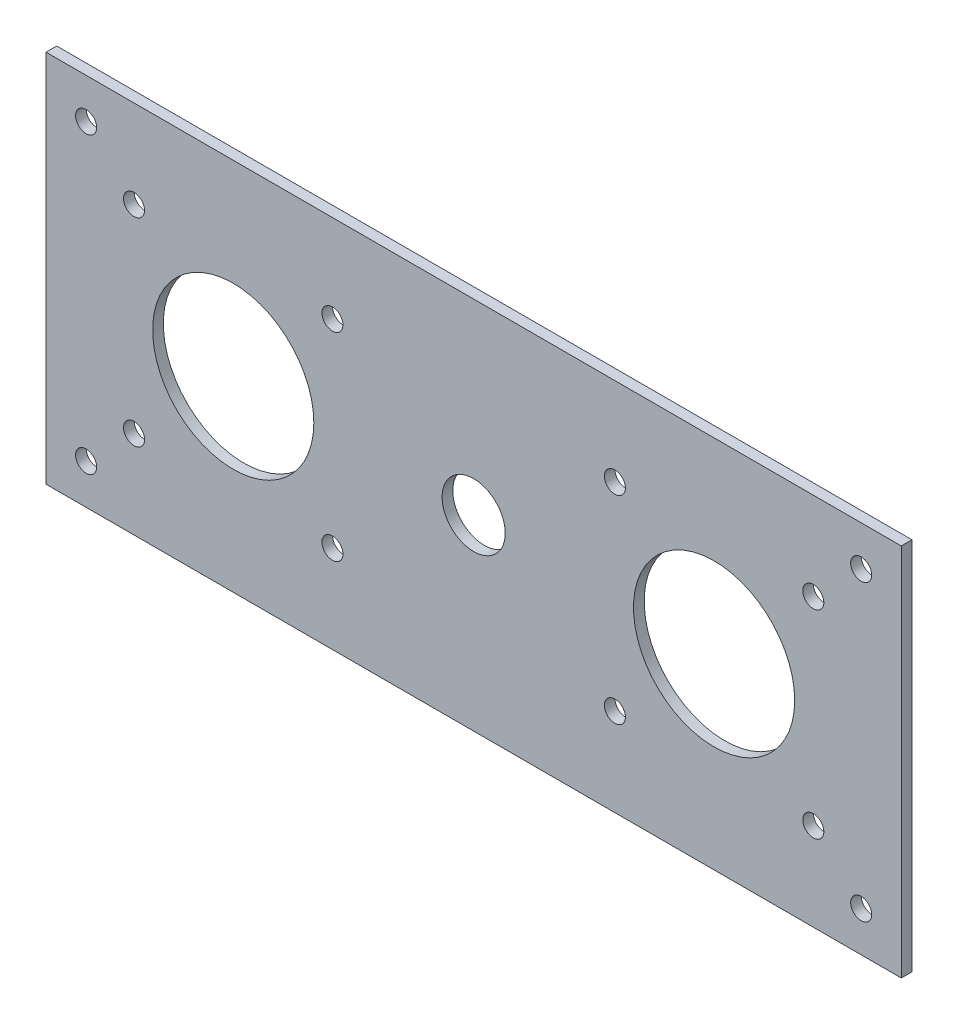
ISO-10303-21;
HEADER;
FILE_DESCRIPTION(('STEP AP214'),'2;1');
FILE_NAME('part.step','',(''),(''),'','','');
FILE_SCHEMA(('AUTOMOTIVE_DESIGN { 1 0 10303 214 1 1 1 1 }'));
ENDSEC;
DATA;
#1=APPLICATION_CONTEXT('core data for automotive mechanical design processes');
#2=APPLICATION_PROTOCOL_DEFINITION('international standard','automotive_design',2000,#1);
#3=PRODUCT_CONTEXT('',#1,'mechanical');
#4=PRODUCT('Part','Part','',(#3));
#5=PRODUCT_RELATED_PRODUCT_CATEGORY('part','',(#4));
#6=PRODUCT_DEFINITION_FORMATION('','',#4);
#7=PRODUCT_DEFINITION_CONTEXT('part definition',#1,'design');
#8=PRODUCT_DEFINITION('design','',#6,#7);
#9=PRODUCT_DEFINITION_SHAPE('','',#8);
#10=(LENGTH_UNIT() NAMED_UNIT(*) SI_UNIT(.MILLI.,.METRE.));
#11=(NAMED_UNIT(*) PLANE_ANGLE_UNIT() SI_UNIT($,.RADIAN.));
#12=(NAMED_UNIT(*) SI_UNIT($,.STERADIAN.) SOLID_ANGLE_UNIT());
#13=UNCERTAINTY_MEASURE_WITH_UNIT(LENGTH_MEASURE(1.E-05),#10,'distance_accuracy_value','');
#14=(GEOMETRIC_REPRESENTATION_CONTEXT(3) GLOBAL_UNCERTAINTY_ASSIGNED_CONTEXT((#13)) GLOBAL_UNIT_ASSIGNED_CONTEXT((#10,
#11,#12)) REPRESENTATION_CONTEXT('',''));
#15=CARTESIAN_POINT('',(0.,0.,0.));
#16=DIRECTION('',(0.,0.,1.));
#17=DIRECTION('',(1.,0.,0.));
#18=AXIS2_PLACEMENT_3D('',#15,#16,#17);
#19=CARTESIAN_POINT('',(0.,0.,1.27));
#20=DIRECTION('',(0.,0.,-1.));
#21=DIRECTION('',(-1.,0.,0.));
#22=AXIS2_PLACEMENT_3D('',#19,#20,#21);
#23=PLANE('',#22);
#24=CARTESIAN_POINT('',(0.,0.,1.27));
#25=DIRECTION('',(0.,0.,-1.));
#26=DIRECTION('',(-1.,0.,0.));
#27=AXIS2_PLACEMENT_3D('',#24,#25,#26);
#28=CIRCLE('',#27,7.50000000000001);
#29=CARTESIAN_POINT('',(-7.50000000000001,0.,1.27));
#30=VERTEX_POINT('',#29);
#31=EDGE_CURVE('E194',#30,#30,#28,.T.);
#32=ORIENTED_EDGE('',*,*,#31,.T.);
#33=EDGE_LOOP('',(#32));
#34=FACE_BOUND('',#33,.T.);
#35=CARTESIAN_POINT('',(-92.075,34.925,1.27));
#36=DIRECTION('',(0.,0.,1.));
#37=DIRECTION('',(1.,0.,0.));
#38=AXIS2_PLACEMENT_3D('',#35,#36,#37);
#39=CIRCLE('',#38,2.5);
#40=CARTESIAN_POINT('',(-89.575,34.925,1.27));
#41=VERTEX_POINT('',#40);
#42=EDGE_CURVE('E186',#41,#41,#39,.T.);
#43=ORIENTED_EDGE('',*,*,#42,.F.);
#44=EDGE_LOOP('',(#43));
#45=FACE_BOUND('',#44,.T.);
#46=CARTESIAN_POINT('',(92.075,-34.925,1.27));
#47=DIRECTION('',(0.,0.,1.));
#48=DIRECTION('',(1.,0.,0.));
#49=AXIS2_PLACEMENT_3D('',#46,#47,#48);
#50=CIRCLE('',#49,2.5);
#51=CARTESIAN_POINT('',(94.575,-34.925,1.27));
#52=VERTEX_POINT('',#51);
#53=EDGE_CURVE('E179',#52,#52,#50,.T.);
#54=ORIENTED_EDGE('',*,*,#53,.F.);
#55=EDGE_LOOP('',(#54));
#56=FACE_BOUND('',#55,.T.);
#57=CARTESIAN_POINT('',(92.075,34.925,1.27));
#58=DIRECTION('',(0.,0.,1.));
#59=DIRECTION('',(1.,0.,0.));
#60=AXIS2_PLACEMENT_3D('',#57,#58,#59);
#61=CIRCLE('',#60,2.50000000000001);
#62=CARTESIAN_POINT('',(94.575,34.925,1.27));
#63=VERTEX_POINT('',#62);
#64=EDGE_CURVE('E191',#63,#63,#61,.T.);
#65=ORIENTED_EDGE('',*,*,#64,.F.);
#66=EDGE_LOOP('',(#65));
#67=FACE_BOUND('',#66,.T.);
#68=CARTESIAN_POINT('',(-92.075,-34.925,1.27));
#69=DIRECTION('',(0.,0.,1.));
#70=DIRECTION('',(1.,0.,0.));
#71=AXIS2_PLACEMENT_3D('',#68,#69,#70);
#72=CIRCLE('',#71,2.5);
#73=CARTESIAN_POINT('',(-89.575,-34.925,1.27));
#74=VERTEX_POINT('',#73);
#75=EDGE_CURVE('E173',#74,#74,#72,.T.);
#76=ORIENTED_EDGE('',*,*,#75,.F.);
#77=EDGE_LOOP('',(#76));
#78=FACE_BOUND('',#77,.T.);
#79=DIRECTION('',(0.,1.,0.));
#80=VECTOR('',#79,1.);
#81=CARTESIAN_POINT('',(101.6,-44.45,1.27));
#82=LINE('',#81,#80);
#83=CARTESIAN_POINT('',(101.6,-44.45,1.27));
#84=VERTEX_POINT('',#83);
#85=CARTESIAN_POINT('',(101.6,44.45,1.27));
#86=VERTEX_POINT('',#85);
#87=EDGE_CURVE('E86',#84,#86,#82,.T.);
#88=ORIENTED_EDGE('',*,*,#87,.T.);
#89=DIRECTION('',(-1.,0.,0.));
#90=VECTOR('',#89,1.);
#91=CARTESIAN_POINT('',(-101.6,44.45,1.27));
#92=LINE('',#91,#90);
#93=CARTESIAN_POINT('',(-101.6,44.45,1.27));
#94=VERTEX_POINT('',#93);
#95=EDGE_CURVE('E81',#86,#94,#92,.T.);
#96=ORIENTED_EDGE('',*,*,#95,.T.);
#97=DIRECTION('',(0.,-1.,0.));
#98=VECTOR('',#97,1.);
#99=CARTESIAN_POINT('',(-101.6,-44.45,1.27));
#100=LINE('',#99,#98);
#101=CARTESIAN_POINT('',(-101.6,-44.45,1.27));
#102=VERTEX_POINT('',#101);
#103=EDGE_CURVE('E84',#94,#102,#100,.T.);
#104=ORIENTED_EDGE('',*,*,#103,.T.);
#105=DIRECTION('',(1.,0.,0.));
#106=VECTOR('',#105,1.);
#107=CARTESIAN_POINT('',(-101.6,-44.45,1.27));
#108=LINE('',#107,#106);
#109=EDGE_CURVE('E51',#102,#84,#108,.T.);
#110=ORIENTED_EDGE('',*,*,#109,.T.);
#111=EDGE_LOOP('',(#88,#96,#104,#110));
#112=FACE_BOUND('',#111,.T.);
#113=CARTESIAN_POINT('',(-80.695,-23.57,1.27));
#114=DIRECTION('',(0.,0.,1.));
#115=DIRECTION('',(1.,0.,0.));
#116=AXIS2_PLACEMENT_3D('',#113,#114,#115);
#117=CIRCLE('',#116,2.50000000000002);
#118=CARTESIAN_POINT('',(-78.195,-23.57,1.27));
#119=VERTEX_POINT('',#118);
#120=EDGE_CURVE('E101',#119,#119,#117,.T.);
#121=ORIENTED_EDGE('',*,*,#120,.F.);
#122=EDGE_LOOP('',(#121));
#123=FACE_BOUND('',#122,.T.);
#124=CARTESIAN_POINT('',(-33.555,-23.57,1.27));
#125=DIRECTION('',(0.,0.,1.));
#126=DIRECTION('',(1.,0.,0.));
#127=AXIS2_PLACEMENT_3D('',#124,#125,#126);
#128=CIRCLE('',#127,2.50000000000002);
#129=CARTESIAN_POINT('',(-31.055,-23.57,1.27));
#130=VERTEX_POINT('',#129);
#131=EDGE_CURVE('E116',#130,#130,#128,.T.);
#132=ORIENTED_EDGE('',*,*,#131,.F.);
#133=EDGE_LOOP('',(#132));
#134=FACE_BOUND('',#133,.T.);
#135=CARTESIAN_POINT('',(-33.555,23.57,1.27));
#136=DIRECTION('',(0.,0.,1.));
#137=DIRECTION('',(1.,0.,0.));
#138=AXIS2_PLACEMENT_3D('',#135,#136,#137);
#139=CIRCLE('',#138,2.50000000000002);
#140=CARTESIAN_POINT('',(-31.055,23.57,1.27));
#141=VERTEX_POINT('',#140);
#142=EDGE_CURVE('E122',#141,#141,#139,.T.);
#143=ORIENTED_EDGE('',*,*,#142,.F.);
#144=EDGE_LOOP('',(#143));
#145=FACE_BOUND('',#144,.T.);
#146=CARTESIAN_POINT('',(-80.695,23.57,1.27));
#147=DIRECTION('',(0.,0.,1.));
#148=DIRECTION('',(1.,0.,0.));
#149=AXIS2_PLACEMENT_3D('',#146,#147,#148);
#150=CIRCLE('',#149,2.50000000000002);
#151=CARTESIAN_POINT('',(-78.195,23.57,1.27));
#152=VERTEX_POINT('',#151);
#153=EDGE_CURVE('E128',#152,#152,#150,.T.);
#154=ORIENTED_EDGE('',*,*,#153,.F.);
#155=EDGE_LOOP('',(#154));
#156=FACE_BOUND('',#155,.T.);
#157=CARTESIAN_POINT('',(80.695,23.57,1.27));
#158=DIRECTION('',(0.,0.,1.));
#159=DIRECTION('',(1.,0.,0.));
#160=AXIS2_PLACEMENT_3D('',#157,#158,#159);
#161=CIRCLE('',#160,2.50000000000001);
#162=CARTESIAN_POINT('',(83.195,23.57,1.27));
#163=VERTEX_POINT('',#162);
#164=EDGE_CURVE('E134',#163,#163,#161,.T.);
#165=ORIENTED_EDGE('',*,*,#164,.F.);
#166=EDGE_LOOP('',(#165));
#167=FACE_BOUND('',#166,.T.);
#168=CARTESIAN_POINT('',(33.555,23.57,1.27));
#169=DIRECTION('',(0.,0.,1.));
#170=DIRECTION('',(1.,0.,0.));
#171=AXIS2_PLACEMENT_3D('',#168,#169,#170);
#172=CIRCLE('',#171,2.49999999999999);
#173=CARTESIAN_POINT('',(36.055,23.57,1.27));
#174=VERTEX_POINT('',#173);
#175=EDGE_CURVE('E140',#174,#174,#172,.T.);
#176=ORIENTED_EDGE('',*,*,#175,.F.);
#177=EDGE_LOOP('',(#176));
#178=FACE_BOUND('',#177,.T.);
#179=CARTESIAN_POINT('',(80.695,-23.57,1.27));
#180=DIRECTION('',(0.,0.,1.));
#181=DIRECTION('',(1.,0.,0.));
#182=AXIS2_PLACEMENT_3D('',#179,#180,#181);
#183=CIRCLE('',#182,2.5);
#184=CARTESIAN_POINT('',(83.195,-23.57,1.27));
#185=VERTEX_POINT('',#184);
#186=EDGE_CURVE('E146',#185,#185,#183,.T.);
#187=ORIENTED_EDGE('',*,*,#186,.F.);
#188=EDGE_LOOP('',(#187));
#189=FACE_BOUND('',#188,.T.);
#190=CARTESIAN_POINT('',(33.555,-23.57,1.27));
#191=DIRECTION('',(0.,0.,1.));
#192=DIRECTION('',(1.,0.,0.));
#193=AXIS2_PLACEMENT_3D('',#190,#191,#192);
#194=CIRCLE('',#193,2.49999999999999);
#195=CARTESIAN_POINT('',(36.055,-23.57,1.27));
#196=VERTEX_POINT('',#195);
#197=EDGE_CURVE('E152',#196,#196,#194,.T.);
#198=ORIENTED_EDGE('',*,*,#197,.F.);
#199=EDGE_LOOP('',(#198));
#200=FACE_BOUND('',#199,.T.);
#201=CARTESIAN_POINT('',(-57.125,0.,1.27));
#202=DIRECTION('',(0.,0.,1.));
#203=DIRECTION('',(1.,0.,0.));
#204=AXIS2_PLACEMENT_3D('',#201,#202,#203);
#205=CIRCLE('',#204,19.15);
#206=CARTESIAN_POINT('',(-37.975,0.,1.27));
#207=VERTEX_POINT('',#206);
#208=EDGE_CURVE('E158',#207,#207,#205,.T.);
#209=ORIENTED_EDGE('',*,*,#208,.F.);
#210=EDGE_LOOP('',(#209));
#211=FACE_BOUND('',#210,.T.);
#212=CARTESIAN_POINT('',(57.125,0.,1.27));
#213=DIRECTION('',(0.,0.,1.));
#214=DIRECTION('',(1.,0.,0.));
#215=AXIS2_PLACEMENT_3D('',#212,#213,#214);
#216=CIRCLE('',#215,19.15);
#217=CARTESIAN_POINT('',(76.275,0.,1.27));
#218=VERTEX_POINT('',#217);
#219=EDGE_CURVE('E164',#218,#218,#216,.T.);
#220=ORIENTED_EDGE('',*,*,#219,.F.);
#221=EDGE_LOOP('',(#220));
#222=FACE_BOUND('',#221,.T.);
#223=ADVANCED_FACE('F34',(#34,#45,#56,#67,#78,#112,#123,#134,#145,#156,#167,#178,#189,#200,#211,
#222),#23,.F.);
#224=CARTESIAN_POINT('',(0.,0.,-1.27));
#225=DIRECTION('',(0.,0.,-1.));
#226=DIRECTION('',(-1.,0.,0.));
#227=AXIS2_PLACEMENT_3D('',#224,#225,#226);
#228=PLANE('',#227);
#229=CARTESIAN_POINT('',(0.,0.,-1.27));
#230=DIRECTION('',(0.,0.,1.));
#231=DIRECTION('',(1.,0.,0.));
#232=AXIS2_PLACEMENT_3D('',#229,#230,#231);
#233=CIRCLE('',#232,7.50000000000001);
#234=CARTESIAN_POINT('',(7.50000000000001,0.,-1.27));
#235=VERTEX_POINT('',#234);
#236=EDGE_CURVE('E199',#235,#235,#233,.T.);
#237=ORIENTED_EDGE('',*,*,#236,.T.);
#238=EDGE_LOOP('',(#237));
#239=FACE_BOUND('',#238,.T.);
#240=CARTESIAN_POINT('',(-92.075,34.925,-1.27));
#241=DIRECTION('',(0.,0.,1.));
#242=DIRECTION('',(1.,0.,0.));
#243=AXIS2_PLACEMENT_3D('',#240,#241,#242);
#244=CIRCLE('',#243,2.5);
#245=CARTESIAN_POINT('',(-89.575,34.925,-1.27));
#246=VERTEX_POINT('',#245);
#247=EDGE_CURVE('E176',#246,#246,#244,.T.);
#248=ORIENTED_EDGE('',*,*,#247,.T.);
#249=EDGE_LOOP('',(#248));
#250=FACE_BOUND('',#249,.T.);
#251=CARTESIAN_POINT('',(92.075,-34.925,-1.27));
#252=DIRECTION('',(0.,0.,1.));
#253=DIRECTION('',(1.,0.,0.));
#254=AXIS2_PLACEMENT_3D('',#251,#252,#253);
#255=CIRCLE('',#254,2.5);
#256=CARTESIAN_POINT('',(94.575,-34.925,-1.27));
#257=VERTEX_POINT('',#256);
#258=EDGE_CURVE('E182',#257,#257,#255,.T.);
#259=ORIENTED_EDGE('',*,*,#258,.T.);
#260=EDGE_LOOP('',(#259));
#261=FACE_BOUND('',#260,.T.);
#262=CARTESIAN_POINT('',(92.075,34.925,-1.27));
#263=DIRECTION('',(0.,0.,1.));
#264=DIRECTION('',(1.,0.,0.));
#265=AXIS2_PLACEMENT_3D('',#262,#263,#264);
#266=CIRCLE('',#265,2.50000000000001);
#267=CARTESIAN_POINT('',(94.575,34.925,-1.27));
#268=VERTEX_POINT('',#267);
#269=EDGE_CURVE('E183',#268,#268,#266,.T.);
#270=ORIENTED_EDGE('',*,*,#269,.T.);
#271=EDGE_LOOP('',(#270));
#272=FACE_BOUND('',#271,.T.);
#273=CARTESIAN_POINT('',(-92.075,-34.925,-1.27));
#274=DIRECTION('',(0.,0.,1.));
#275=DIRECTION('',(1.,0.,0.));
#276=AXIS2_PLACEMENT_3D('',#273,#274,#275);
#277=CIRCLE('',#276,2.5);
#278=CARTESIAN_POINT('',(-89.575,-34.925,-1.27));
#279=VERTEX_POINT('',#278);
#280=EDGE_CURVE('E170',#279,#279,#277,.T.);
#281=ORIENTED_EDGE('',*,*,#280,.T.);
#282=EDGE_LOOP('',(#281));
#283=FACE_BOUND('',#282,.T.);
#284=CARTESIAN_POINT('',(-57.125,0.,-1.27));
#285=DIRECTION('',(0.,0.,1.));
#286=DIRECTION('',(1.,0.,0.));
#287=AXIS2_PLACEMENT_3D('',#284,#285,#286);
#288=CIRCLE('',#287,19.15);
#289=CARTESIAN_POINT('',(-37.975,0.,-1.27));
#290=VERTEX_POINT('',#289);
#291=EDGE_CURVE('E161',#290,#290,#288,.T.);
#292=ORIENTED_EDGE('',*,*,#291,.T.);
#293=EDGE_LOOP('',(#292));
#294=FACE_BOUND('',#293,.T.);
#295=CARTESIAN_POINT('',(80.695,-23.57,-1.27));
#296=DIRECTION('',(0.,0.,1.));
#297=DIRECTION('',(1.,0.,0.));
#298=AXIS2_PLACEMENT_3D('',#295,#296,#297);
#299=CIRCLE('',#298,2.5);
#300=CARTESIAN_POINT('',(83.195,-23.57,-1.27));
#301=VERTEX_POINT('',#300);
#302=EDGE_CURVE('E149',#301,#301,#299,.T.);
#303=ORIENTED_EDGE('',*,*,#302,.T.);
#304=EDGE_LOOP('',(#303));
#305=FACE_BOUND('',#304,.T.);
#306=CARTESIAN_POINT('',(80.695,23.57,-1.27));
#307=DIRECTION('',(0.,0.,1.));
#308=DIRECTION('',(1.,0.,0.));
#309=AXIS2_PLACEMENT_3D('',#306,#307,#308);
#310=CIRCLE('',#309,2.50000000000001);
#311=CARTESIAN_POINT('',(83.195,23.57,-1.27));
#312=VERTEX_POINT('',#311);
#313=EDGE_CURVE('E137',#312,#312,#310,.T.);
#314=ORIENTED_EDGE('',*,*,#313,.T.);
#315=EDGE_LOOP('',(#314));
#316=FACE_BOUND('',#315,.T.);
#317=CARTESIAN_POINT('',(-33.555,23.57,-1.27));
#318=DIRECTION('',(0.,0.,1.));
#319=DIRECTION('',(1.,0.,0.));
#320=AXIS2_PLACEMENT_3D('',#317,#318,#319);
#321=CIRCLE('',#320,2.50000000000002);
#322=CARTESIAN_POINT('',(-31.055,23.57,-1.27));
#323=VERTEX_POINT('',#322);
#324=EDGE_CURVE('E125',#323,#323,#321,.T.);
#325=ORIENTED_EDGE('',*,*,#324,.T.);
#326=EDGE_LOOP('',(#325));
#327=FACE_BOUND('',#326,.T.);
#328=CARTESIAN_POINT('',(-80.695,-23.57,-1.27));
#329=DIRECTION('',(0.,0.,1.));
#330=DIRECTION('',(1.,0.,0.));
#331=AXIS2_PLACEMENT_3D('',#328,#329,#330);
#332=CIRCLE('',#331,2.50000000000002);
#333=CARTESIAN_POINT('',(-78.195,-23.57,-1.27));
#334=VERTEX_POINT('',#333);
#335=EDGE_CURVE('E113',#334,#334,#332,.T.);
#336=ORIENTED_EDGE('',*,*,#335,.T.);
#337=EDGE_LOOP('',(#336));
#338=FACE_BOUND('',#337,.T.);
#339=DIRECTION('',(0.,1.,0.));
#340=VECTOR('',#339,1.);
#341=CARTESIAN_POINT('',(101.6,-44.45,-1.27));
#342=LINE('',#341,#340);
#343=CARTESIAN_POINT('',(101.6,-44.45,-1.27));
#344=VERTEX_POINT('',#343);
#345=CARTESIAN_POINT('',(101.6,44.45,-1.27));
#346=VERTEX_POINT('',#345);
#347=EDGE_CURVE('E98',#344,#346,#342,.T.);
#348=ORIENTED_EDGE('',*,*,#347,.F.);
#349=DIRECTION('',(1.,0.,0.));
#350=VECTOR('',#349,1.);
#351=CARTESIAN_POINT('',(-101.6,-44.45,-1.27));
#352=LINE('',#351,#350);
#353=CARTESIAN_POINT('',(-101.6,-44.45,-1.27));
#354=VERTEX_POINT('',#353);
#355=EDGE_CURVE('E74',#354,#344,#352,.T.);
#356=ORIENTED_EDGE('',*,*,#355,.F.);
#357=DIRECTION('',(0.,-1.,0.));
#358=VECTOR('',#357,1.);
#359=CARTESIAN_POINT('',(-101.6,-44.45,-1.27));
#360=LINE('',#359,#358);
#361=CARTESIAN_POINT('',(-101.6,44.45,-1.27));
#362=VERTEX_POINT('',#361);
#363=EDGE_CURVE('E68',#362,#354,#360,.T.);
#364=ORIENTED_EDGE('',*,*,#363,.F.);
#365=DIRECTION('',(-1.,0.,0.));
#366=VECTOR('',#365,1.);
#367=CARTESIAN_POINT('',(-101.6,44.45,-1.27));
#368=LINE('',#367,#366);
#369=EDGE_CURVE('E90',#346,#362,#368,.T.);
#370=ORIENTED_EDGE('',*,*,#369,.F.);
#371=EDGE_LOOP('',(#348,#356,#364,#370));
#372=FACE_BOUND('',#371,.T.);
#373=CARTESIAN_POINT('',(-33.555,-23.57,-1.27));
#374=DIRECTION('',(0.,0.,1.));
#375=DIRECTION('',(1.,0.,0.));
#376=AXIS2_PLACEMENT_3D('',#373,#374,#375);
#377=CIRCLE('',#376,2.50000000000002);
#378=CARTESIAN_POINT('',(-31.055,-23.57,-1.27));
#379=VERTEX_POINT('',#378);
#380=EDGE_CURVE('E119',#379,#379,#377,.T.);
#381=ORIENTED_EDGE('',*,*,#380,.T.);
#382=EDGE_LOOP('',(#381));
#383=FACE_BOUND('',#382,.T.);
#384=CARTESIAN_POINT('',(-80.695,23.57,-1.27));
#385=DIRECTION('',(0.,0.,1.));
#386=DIRECTION('',(1.,0.,0.));
#387=AXIS2_PLACEMENT_3D('',#384,#385,#386);
#388=CIRCLE('',#387,2.50000000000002);
#389=CARTESIAN_POINT('',(-78.195,23.57,-1.27));
#390=VERTEX_POINT('',#389);
#391=EDGE_CURVE('E131',#390,#390,#388,.T.);
#392=ORIENTED_EDGE('',*,*,#391,.T.);
#393=EDGE_LOOP('',(#392));
#394=FACE_BOUND('',#393,.T.);
#395=CARTESIAN_POINT('',(33.555,23.57,-1.27));
#396=DIRECTION('',(0.,0.,1.));
#397=DIRECTION('',(1.,0.,0.));
#398=AXIS2_PLACEMENT_3D('',#395,#396,#397);
#399=CIRCLE('',#398,2.49999999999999);
#400=CARTESIAN_POINT('',(36.055,23.57,-1.27));
#401=VERTEX_POINT('',#400);
#402=EDGE_CURVE('E143',#401,#401,#399,.T.);
#403=ORIENTED_EDGE('',*,*,#402,.T.);
#404=EDGE_LOOP('',(#403));
#405=FACE_BOUND('',#404,.T.);
#406=CARTESIAN_POINT('',(33.555,-23.57,-1.27));
#407=DIRECTION('',(0.,0.,1.));
#408=DIRECTION('',(1.,0.,0.));
#409=AXIS2_PLACEMENT_3D('',#406,#407,#408);
#410=CIRCLE('',#409,2.49999999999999);
#411=CARTESIAN_POINT('',(36.055,-23.57,-1.27));
#412=VERTEX_POINT('',#411);
#413=EDGE_CURVE('E155',#412,#412,#410,.T.);
#414=ORIENTED_EDGE('',*,*,#413,.T.);
#415=EDGE_LOOP('',(#414));
#416=FACE_BOUND('',#415,.T.);
#417=CARTESIAN_POINT('',(57.125,0.,-1.27));
#418=DIRECTION('',(0.,0.,1.));
#419=DIRECTION('',(1.,0.,0.));
#420=AXIS2_PLACEMENT_3D('',#417,#418,#419);
#421=CIRCLE('',#420,19.15);
#422=CARTESIAN_POINT('',(76.275,0.,-1.27));
#423=VERTEX_POINT('',#422);
#424=EDGE_CURVE('E167',#423,#423,#421,.T.);
#425=ORIENTED_EDGE('',*,*,#424,.T.);
#426=EDGE_LOOP('',(#425));
#427=FACE_BOUND('',#426,.T.);
#428=ADVANCED_FACE('F109',(#239,#250,#261,#272,#283,#294,#305,#316,#327,#338,#372,#383,#394,
#405,#416,#427),#228,.T.);
#429=CARTESIAN_POINT('',(101.6,-44.45,1.27));
#430=DIRECTION('',(-1.,0.,0.));
#431=DIRECTION('',(0.,0.,1.));
#432=AXIS2_PLACEMENT_3D('',#429,#430,#431);
#433=PLANE('',#432);
#434=ORIENTED_EDGE('',*,*,#347,.T.);
#435=DIRECTION('',(0.,0.,-1.));
#436=VECTOR('',#435,1.);
#437=CARTESIAN_POINT('',(101.6,44.45,1.27));
#438=LINE('',#437,#436);
#439=EDGE_CURVE('E11',#86,#346,#438,.T.);
#440=ORIENTED_EDGE('',*,*,#439,.F.);
#441=ORIENTED_EDGE('',*,*,#87,.F.);
#442=DIRECTION('',(0.,0.,-1.));
#443=VECTOR('',#442,1.);
#444=CARTESIAN_POINT('',(101.6,-44.45,1.27));
#445=LINE('',#444,#443);
#446=EDGE_CURVE('E94',#84,#344,#445,.T.);
#447=ORIENTED_EDGE('',*,*,#446,.T.);
#448=EDGE_LOOP('',(#434,#440,#441,#447));
#449=FACE_BOUND('',#448,.T.);
#450=ADVANCED_FACE('F36',(#449),#433,.F.);
#451=CARTESIAN_POINT('',(-101.6,44.45,1.27));
#452=DIRECTION('',(0.,-1.,0.));
#453=DIRECTION('',(0.,0.,-1.));
#454=AXIS2_PLACEMENT_3D('',#451,#452,#453);
#455=PLANE('',#454);
#456=ORIENTED_EDGE('',*,*,#369,.T.);
#457=DIRECTION('',(0.,0.,-1.));
#458=VECTOR('',#457,1.);
#459=CARTESIAN_POINT('',(-101.6,44.45,1.27));
#460=LINE('',#459,#458);
#461=EDGE_CURVE('E43',#94,#362,#460,.T.);
#462=ORIENTED_EDGE('',*,*,#461,.F.);
#463=ORIENTED_EDGE('',*,*,#95,.F.);
#464=ORIENTED_EDGE('',*,*,#439,.T.);
#465=EDGE_LOOP('',(#456,#462,#463,#464));
#466=FACE_BOUND('',#465,.T.);
#467=ADVANCED_FACE('F89',(#466),#455,.F.);
#468=CARTESIAN_POINT('',(-101.6,-44.45,1.27));
#469=DIRECTION('',(1.,0.,0.));
#470=DIRECTION('',(0.,0.,-1.));
#471=AXIS2_PLACEMENT_3D('',#468,#469,#470);
#472=PLANE('',#471);
#473=ORIENTED_EDGE('',*,*,#363,.T.);
#474=DIRECTION('',(0.,0.,-1.));
#475=VECTOR('',#474,1.);
#476=CARTESIAN_POINT('',(-101.6,-44.45,1.27));
#477=LINE('',#476,#475);
#478=EDGE_CURVE('E91',#102,#354,#477,.T.);
#479=ORIENTED_EDGE('',*,*,#478,.F.);
#480=ORIENTED_EDGE('',*,*,#103,.F.);
#481=ORIENTED_EDGE('',*,*,#461,.T.);
#482=EDGE_LOOP('',(#473,#479,#480,#481));
#483=FACE_BOUND('',#482,.T.);
#484=ADVANCED_FACE('F92',(#483),#472,.F.);
#485=CARTESIAN_POINT('',(-101.6,-44.45,1.27));
#486=DIRECTION('',(0.,1.,0.));
#487=DIRECTION('',(0.,0.,1.));
#488=AXIS2_PLACEMENT_3D('',#485,#486,#487);
#489=PLANE('',#488);
#490=ORIENTED_EDGE('',*,*,#355,.T.);
#491=ORIENTED_EDGE('',*,*,#446,.F.);
#492=ORIENTED_EDGE('',*,*,#109,.F.);
#493=ORIENTED_EDGE('',*,*,#478,.T.);
#494=EDGE_LOOP('',(#490,#491,#492,#493));
#495=FACE_BOUND('',#494,.T.);
#496=ADVANCED_FACE('F106',(#495),#489,.F.);
#497=CARTESIAN_POINT('',(-80.695,-23.57,1.27));
#498=DIRECTION('',(0.,0.,-1.));
#499=DIRECTION('',(-1.,0.,0.));
#500=AXIS2_PLACEMENT_3D('',#497,#498,#499);
#501=CYLINDRICAL_SURFACE('',#500,2.50000000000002);
#502=ORIENTED_EDGE('',*,*,#120,.T.);
#503=EDGE_LOOP('',(#502));
#504=FACE_BOUND('',#503,.T.);
#505=ORIENTED_EDGE('',*,*,#335,.F.);
#506=EDGE_LOOP('',(#505));
#507=FACE_BOUND('',#506,.T.);
#508=ADVANCED_FACE('F273',(#504,#507),#501,.F.);
#509=CARTESIAN_POINT('',(-33.555,-23.57,1.27));
#510=DIRECTION('',(0.,0.,-1.));
#511=DIRECTION('',(-1.,0.,0.));
#512=AXIS2_PLACEMENT_3D('',#509,#510,#511);
#513=CYLINDRICAL_SURFACE('',#512,2.50000000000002);
#514=ORIENTED_EDGE('',*,*,#131,.T.);
#515=EDGE_LOOP('',(#514));
#516=FACE_BOUND('',#515,.T.);
#517=ORIENTED_EDGE('',*,*,#380,.F.);
#518=EDGE_LOOP('',(#517));
#519=FACE_BOUND('',#518,.T.);
#520=ADVANCED_FACE('F269',(#516,#519),#513,.F.);
#521=CARTESIAN_POINT('',(-33.555,23.57,1.27));
#522=DIRECTION('',(0.,0.,-1.));
#523=DIRECTION('',(-1.,0.,0.));
#524=AXIS2_PLACEMENT_3D('',#521,#522,#523);
#525=CYLINDRICAL_SURFACE('',#524,2.50000000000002);
#526=ORIENTED_EDGE('',*,*,#142,.T.);
#527=EDGE_LOOP('',(#526));
#528=FACE_BOUND('',#527,.T.);
#529=ORIENTED_EDGE('',*,*,#324,.F.);
#530=EDGE_LOOP('',(#529));
#531=FACE_BOUND('',#530,.T.);
#532=ADVANCED_FACE('F265',(#528,#531),#525,.F.);
#533=CARTESIAN_POINT('',(-80.695,23.57,1.27));
#534=DIRECTION('',(0.,0.,-1.));
#535=DIRECTION('',(-1.,0.,0.));
#536=AXIS2_PLACEMENT_3D('',#533,#534,#535);
#537=CYLINDRICAL_SURFACE('',#536,2.50000000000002);
#538=ORIENTED_EDGE('',*,*,#153,.T.);
#539=EDGE_LOOP('',(#538));
#540=FACE_BOUND('',#539,.T.);
#541=ORIENTED_EDGE('',*,*,#391,.F.);
#542=EDGE_LOOP('',(#541));
#543=FACE_BOUND('',#542,.T.);
#544=ADVANCED_FACE('F261',(#540,#543),#537,.F.);
#545=CARTESIAN_POINT('',(80.695,23.57,1.27));
#546=DIRECTION('',(0.,0.,-1.));
#547=DIRECTION('',(-1.,0.,0.));
#548=AXIS2_PLACEMENT_3D('',#545,#546,#547);
#549=CYLINDRICAL_SURFACE('',#548,2.50000000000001);
#550=ORIENTED_EDGE('',*,*,#164,.T.);
#551=EDGE_LOOP('',(#550));
#552=FACE_BOUND('',#551,.T.);
#553=ORIENTED_EDGE('',*,*,#313,.F.);
#554=EDGE_LOOP('',(#553));
#555=FACE_BOUND('',#554,.T.);
#556=ADVANCED_FACE('F257',(#552,#555),#549,.F.);
#557=CARTESIAN_POINT('',(33.555,23.57,1.27));
#558=DIRECTION('',(0.,0.,-1.));
#559=DIRECTION('',(-1.,0.,0.));
#560=AXIS2_PLACEMENT_3D('',#557,#558,#559);
#561=CYLINDRICAL_SURFACE('',#560,2.49999999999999);
#562=ORIENTED_EDGE('',*,*,#175,.T.);
#563=EDGE_LOOP('',(#562));
#564=FACE_BOUND('',#563,.T.);
#565=ORIENTED_EDGE('',*,*,#402,.F.);
#566=EDGE_LOOP('',(#565));
#567=FACE_BOUND('',#566,.T.);
#568=ADVANCED_FACE('F253',(#564,#567),#561,.F.);
#569=CARTESIAN_POINT('',(80.695,-23.57,1.27));
#570=DIRECTION('',(0.,0.,-1.));
#571=DIRECTION('',(-1.,0.,0.));
#572=AXIS2_PLACEMENT_3D('',#569,#570,#571);
#573=CYLINDRICAL_SURFACE('',#572,2.5);
#574=ORIENTED_EDGE('',*,*,#186,.T.);
#575=EDGE_LOOP('',(#574));
#576=FACE_BOUND('',#575,.T.);
#577=ORIENTED_EDGE('',*,*,#302,.F.);
#578=EDGE_LOOP('',(#577));
#579=FACE_BOUND('',#578,.T.);
#580=ADVANCED_FACE('F249',(#576,#579),#573,.F.);
#581=CARTESIAN_POINT('',(33.555,-23.57,1.27));
#582=DIRECTION('',(0.,0.,-1.));
#583=DIRECTION('',(-1.,0.,0.));
#584=AXIS2_PLACEMENT_3D('',#581,#582,#583);
#585=CYLINDRICAL_SURFACE('',#584,2.49999999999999);
#586=ORIENTED_EDGE('',*,*,#197,.T.);
#587=EDGE_LOOP('',(#586));
#588=FACE_BOUND('',#587,.T.);
#589=ORIENTED_EDGE('',*,*,#413,.F.);
#590=EDGE_LOOP('',(#589));
#591=FACE_BOUND('',#590,.T.);
#592=ADVANCED_FACE('F245',(#588,#591),#585,.F.);
#593=CARTESIAN_POINT('',(-57.125,0.,1.27));
#594=DIRECTION('',(0.,0.,-1.));
#595=DIRECTION('',(-1.,0.,0.));
#596=AXIS2_PLACEMENT_3D('',#593,#594,#595);
#597=CYLINDRICAL_SURFACE('',#596,19.15);
#598=ORIENTED_EDGE('',*,*,#208,.T.);
#599=EDGE_LOOP('',(#598));
#600=FACE_BOUND('',#599,.T.);
#601=ORIENTED_EDGE('',*,*,#291,.F.);
#602=EDGE_LOOP('',(#601));
#603=FACE_BOUND('',#602,.T.);
#604=ADVANCED_FACE('F236',(#600,#603),#597,.F.);
#605=CARTESIAN_POINT('',(57.125,0.,1.27));
#606=DIRECTION('',(0.,0.,-1.));
#607=DIRECTION('',(-1.,0.,0.));
#608=AXIS2_PLACEMENT_3D('',#605,#606,#607);
#609=CYLINDRICAL_SURFACE('',#608,19.15);
#610=ORIENTED_EDGE('',*,*,#219,.T.);
#611=EDGE_LOOP('',(#610));
#612=FACE_BOUND('',#611,.T.);
#613=ORIENTED_EDGE('',*,*,#424,.F.);
#614=EDGE_LOOP('',(#613));
#615=FACE_BOUND('',#614,.T.);
#616=ADVANCED_FACE('F226',(#612,#615),#609,.F.);
#617=CARTESIAN_POINT('',(-92.075,-34.925,-1.27));
#618=DIRECTION('',(0.,0.,1.));
#619=DIRECTION('',(1.,0.,0.));
#620=AXIS2_PLACEMENT_3D('',#617,#618,#619);
#621=CYLINDRICAL_SURFACE('',#620,2.5);
#622=ORIENTED_EDGE('',*,*,#280,.F.);
#623=EDGE_LOOP('',(#622));
#624=FACE_BOUND('',#623,.T.);
#625=ORIENTED_EDGE('',*,*,#75,.T.);
#626=EDGE_LOOP('',(#625));
#627=FACE_BOUND('',#626,.T.);
#628=ADVANCED_FACE('F223',(#624,#627),#621,.F.);
#629=CARTESIAN_POINT('',(92.075,34.925,-1.27));
#630=DIRECTION('',(0.,0.,1.));
#631=DIRECTION('',(1.,0.,0.));
#632=AXIS2_PLACEMENT_3D('',#629,#630,#631);
#633=CYLINDRICAL_SURFACE('',#632,2.50000000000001);
#634=ORIENTED_EDGE('',*,*,#269,.F.);
#635=EDGE_LOOP('',(#634));
#636=FACE_BOUND('',#635,.T.);
#637=ORIENTED_EDGE('',*,*,#64,.T.);
#638=EDGE_LOOP('',(#637));
#639=FACE_BOUND('',#638,.T.);
#640=ADVANCED_FACE('F225',(#636,#639),#633,.F.);
#641=CARTESIAN_POINT('',(92.075,-34.925,-1.27));
#642=DIRECTION('',(0.,0.,1.));
#643=DIRECTION('',(1.,0.,0.));
#644=AXIS2_PLACEMENT_3D('',#641,#642,#643);
#645=CYLINDRICAL_SURFACE('',#644,2.5);
#646=ORIENTED_EDGE('',*,*,#258,.F.);
#647=EDGE_LOOP('',(#646));
#648=FACE_BOUND('',#647,.T.);
#649=ORIENTED_EDGE('',*,*,#53,.T.);
#650=EDGE_LOOP('',(#649));
#651=FACE_BOUND('',#650,.T.);
#652=ADVANCED_FACE('F233',(#648,#651),#645,.F.);
#653=CARTESIAN_POINT('',(-92.075,34.925,-1.27));
#654=DIRECTION('',(0.,0.,1.));
#655=DIRECTION('',(1.,0.,0.));
#656=AXIS2_PLACEMENT_3D('',#653,#654,#655);
#657=CYLINDRICAL_SURFACE('',#656,2.5);
#658=ORIENTED_EDGE('',*,*,#247,.F.);
#659=EDGE_LOOP('',(#658));
#660=FACE_BOUND('',#659,.T.);
#661=ORIENTED_EDGE('',*,*,#42,.T.);
#662=EDGE_LOOP('',(#661));
#663=FACE_BOUND('',#662,.T.);
#664=ADVANCED_FACE('F208',(#660,#663),#657,.F.);
#665=CARTESIAN_POINT('',(0.,0.,-1.27));
#666=DIRECTION('',(0.,0.,1.));
#667=DIRECTION('',(1.,0.,0.));
#668=AXIS2_PLACEMENT_3D('',#665,#666,#667);
#669=CYLINDRICAL_SURFACE('',#668,7.50000000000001);
#670=ORIENTED_EDGE('',*,*,#236,.F.);
#671=EDGE_LOOP('',(#670));
#672=FACE_BOUND('',#671,.T.);
#673=ORIENTED_EDGE('',*,*,#31,.F.);
#674=EDGE_LOOP('',(#673));
#675=FACE_BOUND('',#674,.T.);
#676=ADVANCED_FACE('F205',(#672,#675),#669,.F.);
#677=CLOSED_SHELL('',(#223,#428,#450,#467,#484,#496,#508,#520,#532,#544,#556,#568,#580,#592,
#604,#616,#628,#640,#652,#664,#676));
#678=MANIFOLD_SOLID_BREP('B2',#677);
#679=ADVANCED_BREP_SHAPE_REPRESENTATION('',(#18,#678),#14);
#680=SHAPE_DEFINITION_REPRESENTATION(#9,#679);
ENDSEC;
END-ISO-10303-21;
